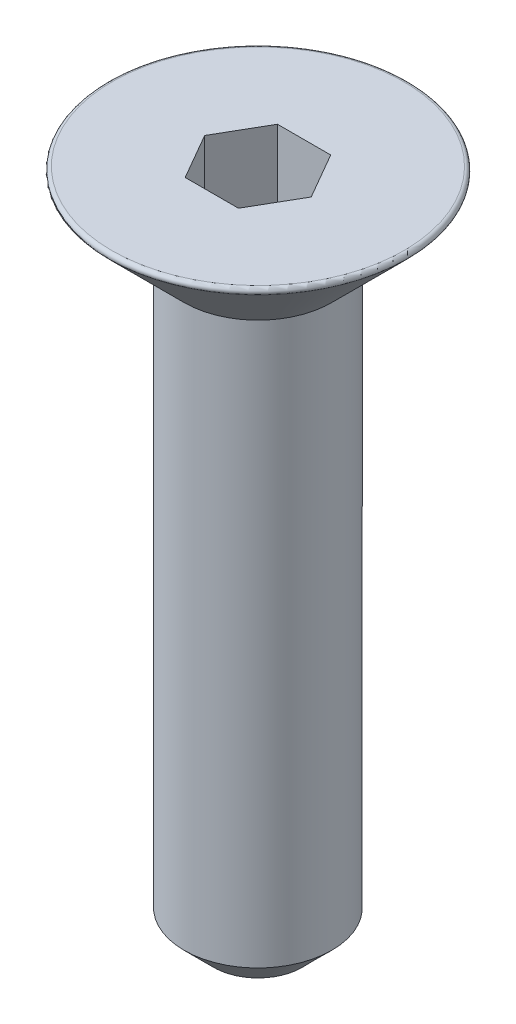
from build123d import *

# Parameters (mm, degrees)
CONG_1_R                = 0.1
CHANFREIN1_SIZE         = 0.8
ENL_V_MAT_EXTRU_1_DEPTH = 3


with BuildPart() as part:
    # Esquisse1 → R_volution1 (revolve)
    with BuildSketch(Plane.XY, mode=Mode.PRIVATE) as r_volution1_sk:
        Polygon((0, 0), (-4.2, 0), (-2, -2.2), (-2, -18.2), (0, -18.2), align=None)
    revolve(r_volution1_sk.sketch.rotate(Axis((0, 15.487971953, 0), (0, -1, 0)), 270), axis=Axis((0, 15.487971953, 0), (0, -1, 0)))

    # Cong_1
    cong_1_edges = [part.edges().sort_by_distance(p)[0] for p in [
        (0, 0, -4.2),
    ]]
    fillet(cong_1_edges, radius=CONG_1_R)

    # Chanfrein1
    chanfrein1_edges = [part.edges().sort_by_distance(p)[0] for p in [
        (0, -18.2, -2),
    ]]
    chamfer(chanfrein1_edges, length=CHANFREIN1_SIZE)

    # Esquisse2 → Enl_v. mat.-Extru.1 (cut)
    with BuildSketch(Plane(origin=(0, 0, 0), x_dir=(1, 0, 0), z_dir=(0, 1, 0))):
        Polygon((1.443375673, 0), (0.721687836, 1.25), (-0.721687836, 1.25), (-1.443375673, 0), (-0.721687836, -1.25), (0.721687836, -1.25), align=None)
    extrude(amount=-ENL_V_MAT_EXTRU_1_DEPTH, mode=Mode.SUBTRACT)


solid = part.part
